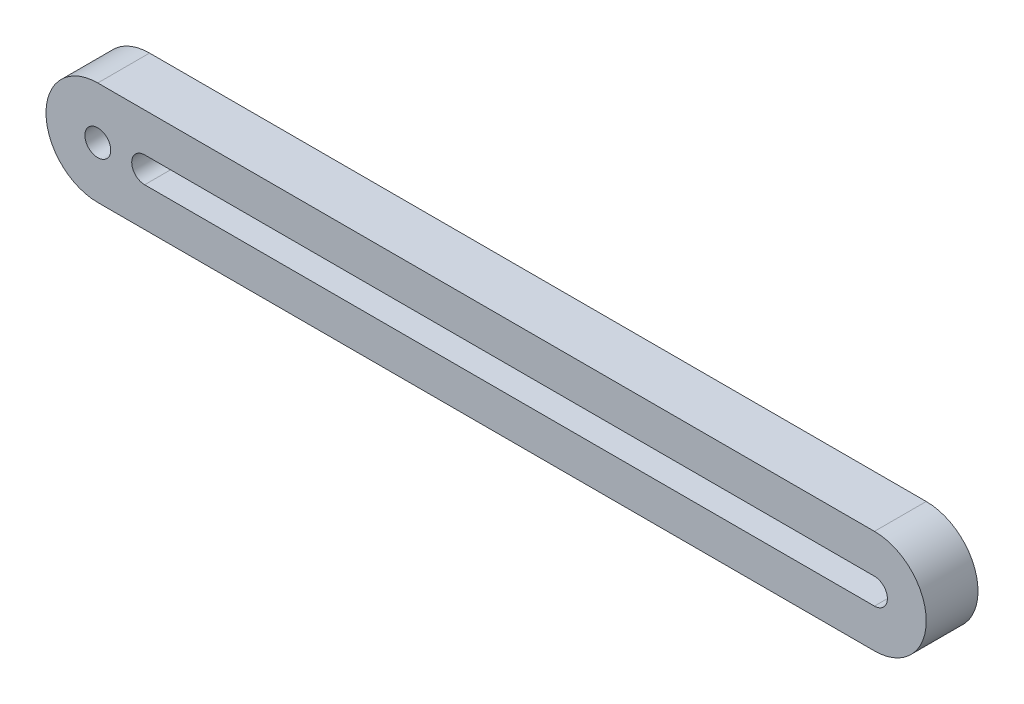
ISO-10303-21;
HEADER;
FILE_DESCRIPTION(('STEP AP214'),'2;1');
FILE_NAME('part.step','',(''),(''),'','','');
FILE_SCHEMA(('AUTOMOTIVE_DESIGN { 1 0 10303 214 1 1 1 1 }'));
ENDSEC;
DATA;
#1=APPLICATION_CONTEXT('core data for automotive mechanical design processes');
#2=APPLICATION_PROTOCOL_DEFINITION('international standard','automotive_design',2000,#1);
#3=PRODUCT_CONTEXT('',#1,'mechanical');
#4=PRODUCT('Part','Part','',(#3));
#5=PRODUCT_RELATED_PRODUCT_CATEGORY('part','',(#4));
#6=PRODUCT_DEFINITION_FORMATION('','',#4);
#7=PRODUCT_DEFINITION_CONTEXT('part definition',#1,'design');
#8=PRODUCT_DEFINITION('design','',#6,#7);
#9=PRODUCT_DEFINITION_SHAPE('','',#8);
#10=(LENGTH_UNIT() NAMED_UNIT(*) SI_UNIT(.MILLI.,.METRE.));
#11=(NAMED_UNIT(*) PLANE_ANGLE_UNIT() SI_UNIT($,.RADIAN.));
#12=(NAMED_UNIT(*) SI_UNIT($,.STERADIAN.) SOLID_ANGLE_UNIT());
#13=UNCERTAINTY_MEASURE_WITH_UNIT(LENGTH_MEASURE(1.E-05),#10,'distance_accuracy_value','');
#14=(GEOMETRIC_REPRESENTATION_CONTEXT(3) GLOBAL_UNCERTAINTY_ASSIGNED_CONTEXT((#13)) GLOBAL_UNIT_ASSIGNED_CONTEXT((#10,
#11,#12)) REPRESENTATION_CONTEXT('',''));
#15=CARTESIAN_POINT('',(0.,0.,0.));
#16=DIRECTION('',(0.,0.,1.));
#17=DIRECTION('',(1.,0.,0.));
#18=AXIS2_PLACEMENT_3D('',#15,#16,#17);
#19=CARTESIAN_POINT('',(0.,0.,2.54));
#20=DIRECTION('',(0.,0.,-1.));
#21=DIRECTION('',(-1.,0.,0.));
#22=AXIS2_PLACEMENT_3D('',#19,#20,#21);
#23=CYLINDRICAL_SURFACE('',#22,2.54);
#24=CARTESIAN_POINT('',(0.,0.,0.));
#25=DIRECTION('',(0.,0.,1.));
#26=DIRECTION('',(1.,0.,0.));
#27=AXIS2_PLACEMENT_3D('',#24,#25,#26);
#28=CIRCLE('',#27,2.54);
#29=CARTESIAN_POINT('',(0.,2.54,0.));
#30=VERTEX_POINT('',#29);
#31=CARTESIAN_POINT('',(0.,-2.54,0.));
#32=VERTEX_POINT('',#31);
#33=EDGE_CURVE('E122',#30,#32,#28,.T.);
#34=ORIENTED_EDGE('',*,*,#33,.T.);
#35=DIRECTION('',(0.,0.,-1.));
#36=VECTOR('',#35,1.);
#37=CARTESIAN_POINT('',(0.,-2.54,2.54));
#38=LINE('',#37,#36);
#39=CARTESIAN_POINT('',(0.,-2.54,2.54));
#40=VERTEX_POINT('',#39);
#41=EDGE_CURVE('E11',#40,#32,#38,.T.);
#42=ORIENTED_EDGE('',*,*,#41,.F.);
#43=CARTESIAN_POINT('',(0.,0.,2.54));
#44=DIRECTION('',(0.,0.,1.));
#45=DIRECTION('',(1.,0.,0.));
#46=AXIS2_PLACEMENT_3D('',#43,#44,#45);
#47=CIRCLE('',#46,2.54);
#48=CARTESIAN_POINT('',(0.,2.54,2.54));
#49=VERTEX_POINT('',#48);
#50=EDGE_CURVE('E117',#49,#40,#47,.T.);
#51=ORIENTED_EDGE('',*,*,#50,.F.);
#52=DIRECTION('',(0.,0.,-1.));
#53=VECTOR('',#52,1.);
#54=CARTESIAN_POINT('',(0.,2.54,2.54));
#55=LINE('',#54,#53);
#56=EDGE_CURVE('E112',#49,#30,#55,.T.);
#57=ORIENTED_EDGE('',*,*,#56,.T.);
#58=EDGE_LOOP('',(#34,#42,#51,#57));
#59=FACE_BOUND('',#58,.T.);
#60=ADVANCED_FACE('F32',(#59),#23,.T.);
#61=CARTESIAN_POINT('',(0.,-2.54,2.54));
#62=DIRECTION('',(0.,1.,0.));
#63=DIRECTION('',(0.,0.,1.));
#64=AXIS2_PLACEMENT_3D('',#61,#62,#63);
#65=PLANE('',#64);
#66=DIRECTION('',(1.,0.,0.));
#67=VECTOR('',#66,1.);
#68=CARTESIAN_POINT('',(0.,-2.54,0.));
#69=LINE('',#68,#67);
#70=CARTESIAN_POINT('',(38.1,-2.54,0.));
#71=VERTEX_POINT('',#70);
#72=EDGE_CURVE('E127',#32,#71,#69,.T.);
#73=ORIENTED_EDGE('',*,*,#72,.T.);
#74=DIRECTION('',(0.,0.,-1.));
#75=VECTOR('',#74,1.);
#76=CARTESIAN_POINT('',(38.1,-2.54,2.54));
#77=LINE('',#76,#75);
#78=CARTESIAN_POINT('',(38.1,-2.54,2.54));
#79=VERTEX_POINT('',#78);
#80=EDGE_CURVE('E41',#79,#71,#77,.T.);
#81=ORIENTED_EDGE('',*,*,#80,.F.);
#82=DIRECTION('',(1.,0.,0.));
#83=VECTOR('',#82,1.);
#84=CARTESIAN_POINT('',(0.,-2.54,2.54));
#85=LINE('',#84,#83);
#86=EDGE_CURVE('E156',#40,#79,#85,.T.);
#87=ORIENTED_EDGE('',*,*,#86,.F.);
#88=ORIENTED_EDGE('',*,*,#41,.T.);
#89=EDGE_LOOP('',(#73,#81,#87,#88));
#90=FACE_BOUND('',#89,.T.);
#91=ADVANCED_FACE('F163',(#90),#65,.F.);
#92=CARTESIAN_POINT('',(38.1,0.,2.54));
#93=DIRECTION('',(0.,0.,-1.));
#94=DIRECTION('',(-1.,0.,0.));
#95=AXIS2_PLACEMENT_3D('',#92,#93,#94);
#96=CYLINDRICAL_SURFACE('',#95,2.54);
#97=CARTESIAN_POINT('',(38.1,0.,0.));
#98=DIRECTION('',(0.,0.,1.));
#99=DIRECTION('',(1.,0.,0.));
#100=AXIS2_PLACEMENT_3D('',#97,#98,#99);
#101=CIRCLE('',#100,2.54);
#102=CARTESIAN_POINT('',(38.1,2.54,0.));
#103=VERTEX_POINT('',#102);
#104=EDGE_CURVE('E102',#71,#103,#101,.T.);
#105=ORIENTED_EDGE('',*,*,#104,.T.);
#106=DIRECTION('',(0.,0.,-1.));
#107=VECTOR('',#106,1.);
#108=CARTESIAN_POINT('',(38.1,2.54,2.54));
#109=LINE('',#108,#107);
#110=CARTESIAN_POINT('',(38.1,2.54,2.54));
#111=VERTEX_POINT('',#110);
#112=EDGE_CURVE('E114',#111,#103,#109,.T.);
#113=ORIENTED_EDGE('',*,*,#112,.F.);
#114=CARTESIAN_POINT('',(38.1,0.,2.54));
#115=DIRECTION('',(0.,0.,1.));
#116=DIRECTION('',(1.,0.,0.));
#117=AXIS2_PLACEMENT_3D('',#114,#115,#116);
#118=CIRCLE('',#117,2.54);
#119=EDGE_CURVE('E157',#79,#111,#118,.T.);
#120=ORIENTED_EDGE('',*,*,#119,.F.);
#121=ORIENTED_EDGE('',*,*,#80,.T.);
#122=EDGE_LOOP('',(#105,#113,#120,#121));
#123=FACE_BOUND('',#122,.T.);
#124=ADVANCED_FACE('F164',(#123),#96,.T.);
#125=CARTESIAN_POINT('',(0.,2.54,2.54));
#126=DIRECTION('',(0.,-1.,0.));
#127=DIRECTION('',(0.,0.,-1.));
#128=AXIS2_PLACEMENT_3D('',#125,#126,#127);
#129=PLANE('',#128);
#130=DIRECTION('',(-1.,0.,0.));
#131=VECTOR('',#130,1.);
#132=CARTESIAN_POINT('',(0.,2.54,0.));
#133=LINE('',#132,#131);
#134=EDGE_CURVE('E108',#103,#30,#133,.T.);
#135=ORIENTED_EDGE('',*,*,#134,.T.);
#136=ORIENTED_EDGE('',*,*,#56,.F.);
#137=DIRECTION('',(-1.,0.,0.));
#138=VECTOR('',#137,1.);
#139=CARTESIAN_POINT('',(0.,2.54,2.54));
#140=LINE('',#139,#138);
#141=EDGE_CURVE('E124',#111,#49,#140,.T.);
#142=ORIENTED_EDGE('',*,*,#141,.F.);
#143=ORIENTED_EDGE('',*,*,#112,.T.);
#144=EDGE_LOOP('',(#135,#136,#142,#143));
#145=FACE_BOUND('',#144,.T.);
#146=ADVANCED_FACE('F110',(#145),#129,.F.);
#147=CARTESIAN_POINT('',(0.,0.,2.54));
#148=DIRECTION('',(0.,0.,1.));
#149=DIRECTION('',(1.,0.,0.));
#150=AXIS2_PLACEMENT_3D('',#147,#148,#149);
#151=PLANE('',#150);
#152=DIRECTION('',(1.,0.,0.));
#153=VECTOR('',#152,1.);
#154=CARTESIAN_POINT('',(2.29995629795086,0.635,2.54));
#155=LINE('',#154,#153);
#156=CARTESIAN_POINT('',(38.1,0.635,2.54));
#157=VERTEX_POINT('',#156);
#158=CARTESIAN_POINT('',(2.29995629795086,0.635,2.54));
#159=VERTEX_POINT('',#158);
#160=EDGE_CURVE('E68',#157,#159,#155,.F.);
#161=ORIENTED_EDGE('',*,*,#160,.F.);
#162=CARTESIAN_POINT('',(38.1,0.,2.54));
#163=DIRECTION('',(0.,0.,1.));
#164=DIRECTION('',(1.,0.,0.));
#165=AXIS2_PLACEMENT_3D('',#162,#163,#164);
#166=CIRCLE('',#165,0.635);
#167=CARTESIAN_POINT('',(38.1,-0.635,2.54));
#168=VERTEX_POINT('',#167);
#169=EDGE_CURVE('E141',#157,#168,#166,.F.);
#170=ORIENTED_EDGE('',*,*,#169,.T.);
#171=DIRECTION('',(1.,0.,0.));
#172=VECTOR('',#171,1.);
#173=CARTESIAN_POINT('',(2.29995629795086,-0.635,2.54));
#174=LINE('',#173,#172);
#175=CARTESIAN_POINT('',(2.29995629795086,-0.635,2.54));
#176=VERTEX_POINT('',#175);
#177=EDGE_CURVE('E50',#176,#168,#174,.T.);
#178=ORIENTED_EDGE('',*,*,#177,.F.);
#179=CARTESIAN_POINT('',(2.29995629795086,0.,2.54));
#180=DIRECTION('',(0.,0.,1.));
#181=DIRECTION('',(1.,0.,0.));
#182=AXIS2_PLACEMENT_3D('',#179,#180,#181);
#183=CIRCLE('',#182,0.635);
#184=EDGE_CURVE('E35',#159,#176,#183,.T.);
#185=ORIENTED_EDGE('',*,*,#184,.F.);
#186=EDGE_LOOP('',(#161,#170,#178,#185));
#187=FACE_BOUND('',#186,.T.);
#188=CARTESIAN_POINT('',(0.,0.,2.54));
#189=DIRECTION('',(0.,0.,1.));
#190=DIRECTION('',(1.,0.,0.));
#191=AXIS2_PLACEMENT_3D('',#188,#189,#190);
#192=CIRCLE('',#191,0.635);
#193=CARTESIAN_POINT('',(0.635,0.,2.54));
#194=VERTEX_POINT('',#193);
#195=EDGE_CURVE('E128',#194,#194,#192,.T.);
#196=ORIENTED_EDGE('',*,*,#195,.F.);
#197=EDGE_LOOP('',(#196));
#198=FACE_BOUND('',#197,.T.);
#199=ORIENTED_EDGE('',*,*,#50,.T.);
#200=ORIENTED_EDGE('',*,*,#86,.T.);
#201=ORIENTED_EDGE('',*,*,#119,.T.);
#202=ORIENTED_EDGE('',*,*,#141,.T.);
#203=EDGE_LOOP('',(#199,#200,#201,#202));
#204=FACE_BOUND('',#203,.T.);
#205=ADVANCED_FACE('F160',(#187,#198,#204),#151,.T.);
#206=CARTESIAN_POINT('',(0.,0.,0.));
#207=DIRECTION('',(0.,0.,1.));
#208=DIRECTION('',(1.,0.,0.));
#209=AXIS2_PLACEMENT_3D('',#206,#207,#208);
#210=PLANE('',#209);
#211=CARTESIAN_POINT('',(38.1,0.,0.));
#212=DIRECTION('',(0.,0.,-1.));
#213=DIRECTION('',(-1.,0.,0.));
#214=AXIS2_PLACEMENT_3D('',#211,#212,#213);
#215=CIRCLE('',#214,0.635);
#216=CARTESIAN_POINT('',(38.1,0.635,0.));
#217=VERTEX_POINT('',#216);
#218=CARTESIAN_POINT('',(38.1,-0.635,0.));
#219=VERTEX_POINT('',#218);
#220=EDGE_CURVE('E143',#217,#219,#215,.T.);
#221=ORIENTED_EDGE('',*,*,#220,.F.);
#222=DIRECTION('',(-1.,0.,0.));
#223=VECTOR('',#222,1.);
#224=CARTESIAN_POINT('',(2.29995629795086,0.635,0.));
#225=LINE('',#224,#223);
#226=CARTESIAN_POINT('',(2.29995629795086,0.635,0.));
#227=VERTEX_POINT('',#226);
#228=EDGE_CURVE('E259',#217,#227,#225,.T.);
#229=ORIENTED_EDGE('',*,*,#228,.T.);
#230=CARTESIAN_POINT('',(2.29995629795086,0.,0.));
#231=DIRECTION('',(0.,0.,1.));
#232=DIRECTION('',(1.,0.,0.));
#233=AXIS2_PLACEMENT_3D('',#230,#231,#232);
#234=CIRCLE('',#233,0.635);
#235=CARTESIAN_POINT('',(2.29995629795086,-0.635,0.));
#236=VERTEX_POINT('',#235);
#237=EDGE_CURVE('E262',#227,#236,#234,.T.);
#238=ORIENTED_EDGE('',*,*,#237,.T.);
#239=DIRECTION('',(1.,0.,0.));
#240=VECTOR('',#239,1.);
#241=CARTESIAN_POINT('',(2.29995629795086,-0.635,0.));
#242=LINE('',#241,#240);
#243=EDGE_CURVE('E261',#236,#219,#242,.T.);
#244=ORIENTED_EDGE('',*,*,#243,.T.);
#245=EDGE_LOOP('',(#221,#229,#238,#244));
#246=FACE_BOUND('',#245,.T.);
#247=CARTESIAN_POINT('',(0.,0.,0.));
#248=DIRECTION('',(0.,0.,1.));
#249=DIRECTION('',(1.,0.,0.));
#250=AXIS2_PLACEMENT_3D('',#247,#248,#249);
#251=CIRCLE('',#250,0.635);
#252=CARTESIAN_POINT('',(0.635,0.,0.));
#253=VERTEX_POINT('',#252);
#254=EDGE_CURVE('E132',#253,#253,#251,.T.);
#255=ORIENTED_EDGE('',*,*,#254,.T.);
#256=EDGE_LOOP('',(#255));
#257=FACE_BOUND('',#256,.T.);
#258=ORIENTED_EDGE('',*,*,#33,.F.);
#259=ORIENTED_EDGE('',*,*,#134,.F.);
#260=ORIENTED_EDGE('',*,*,#104,.F.);
#261=ORIENTED_EDGE('',*,*,#72,.F.);
#262=EDGE_LOOP('',(#258,#259,#260,#261));
#263=FACE_BOUND('',#262,.T.);
#264=ADVANCED_FACE('F126',(#246,#257,#263),#210,.F.);
#265=CARTESIAN_POINT('',(0.,0.,0.));
#266=DIRECTION('',(0.,0.,1.));
#267=DIRECTION('',(1.,0.,0.));
#268=AXIS2_PLACEMENT_3D('',#265,#266,#267);
#269=CYLINDRICAL_SURFACE('',#268,0.635);
#270=ORIENTED_EDGE('',*,*,#195,.T.);
#271=EDGE_LOOP('',(#270));
#272=FACE_BOUND('',#271,.T.);
#273=ORIENTED_EDGE('',*,*,#254,.F.);
#274=EDGE_LOOP('',(#273));
#275=FACE_BOUND('',#274,.T.);
#276=ADVANCED_FACE('F196',(#272,#275),#269,.F.);
#277=CARTESIAN_POINT('',(38.1,0.,0.));
#278=DIRECTION('',(0.,0.,1.));
#279=DIRECTION('',(1.,0.,0.));
#280=AXIS2_PLACEMENT_3D('',#277,#278,#279);
#281=CYLINDRICAL_SURFACE('',#280,0.635);
#282=DIRECTION('',(0.,0.,1.));
#283=VECTOR('',#282,1.);
#284=CARTESIAN_POINT('',(38.1,0.635,0.));
#285=LINE('',#284,#283);
#286=EDGE_CURVE('E151',#217,#157,#285,.T.);
#287=ORIENTED_EDGE('',*,*,#286,.F.);
#288=ORIENTED_EDGE('',*,*,#220,.T.);
#289=DIRECTION('',(0.,0.,1.));
#290=VECTOR('',#289,1.);
#291=CARTESIAN_POINT('',(38.1,-0.635,0.));
#292=LINE('',#291,#290);
#293=EDGE_CURVE('E254',#219,#168,#292,.T.);
#294=ORIENTED_EDGE('',*,*,#293,.T.);
#295=ORIENTED_EDGE('',*,*,#169,.F.);
#296=EDGE_LOOP('',(#287,#288,#294,#295));
#297=FACE_BOUND('',#296,.T.);
#298=ADVANCED_FACE('F201',(#297),#281,.F.);
#299=CARTESIAN_POINT('',(2.29995629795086,0.,0.));
#300=DIRECTION('',(0.,0.,1.));
#301=DIRECTION('',(1.,0.,0.));
#302=AXIS2_PLACEMENT_3D('',#299,#300,#301);
#303=CYLINDRICAL_SURFACE('',#302,0.635);
#304=ORIENTED_EDGE('',*,*,#184,.T.);
#305=DIRECTION('',(0.,0.,1.));
#306=VECTOR('',#305,1.);
#307=CARTESIAN_POINT('',(2.29995629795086,-0.635,0.));
#308=LINE('',#307,#306);
#309=EDGE_CURVE('E264',#236,#176,#308,.T.);
#310=ORIENTED_EDGE('',*,*,#309,.F.);
#311=ORIENTED_EDGE('',*,*,#237,.F.);
#312=DIRECTION('',(0.,0.,1.));
#313=VECTOR('',#312,1.);
#314=CARTESIAN_POINT('',(2.29995629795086,0.635,0.));
#315=LINE('',#314,#313);
#316=EDGE_CURVE('E81',#227,#159,#315,.T.);
#317=ORIENTED_EDGE('',*,*,#316,.T.);
#318=EDGE_LOOP('',(#304,#310,#311,#317));
#319=FACE_BOUND('',#318,.T.);
#320=ADVANCED_FACE('F223',(#319),#303,.F.);
#321=CARTESIAN_POINT('',(2.29995629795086,0.635,0.));
#322=DIRECTION('',(0.,1.,0.));
#323=DIRECTION('',(0.,0.,1.));
#324=AXIS2_PLACEMENT_3D('',#321,#322,#323);
#325=PLANE('',#324);
#326=ORIENTED_EDGE('',*,*,#160,.T.);
#327=ORIENTED_EDGE('',*,*,#316,.F.);
#328=ORIENTED_EDGE('',*,*,#228,.F.);
#329=ORIENTED_EDGE('',*,*,#286,.T.);
#330=EDGE_LOOP('',(#326,#327,#328,#329));
#331=FACE_BOUND('',#330,.T.);
#332=ADVANCED_FACE('F230',(#331),#325,.F.);
#333=CARTESIAN_POINT('',(2.29995629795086,-0.635,0.));
#334=DIRECTION('',(0.,-1.,0.));
#335=DIRECTION('',(0.,0.,-1.));
#336=AXIS2_PLACEMENT_3D('',#333,#334,#335);
#337=PLANE('',#336);
#338=ORIENTED_EDGE('',*,*,#177,.T.);
#339=ORIENTED_EDGE('',*,*,#293,.F.);
#340=ORIENTED_EDGE('',*,*,#243,.F.);
#341=ORIENTED_EDGE('',*,*,#309,.T.);
#342=EDGE_LOOP('',(#338,#339,#340,#341));
#343=FACE_BOUND('',#342,.T.);
#344=ADVANCED_FACE('F239',(#343),#337,.F.);
#345=CLOSED_SHELL('',(#60,#91,#124,#146,#205,#264,#276,#298,#320,#332,#344));
#346=MANIFOLD_SOLID_BREP('B2',#345);
#347=ADVANCED_BREP_SHAPE_REPRESENTATION('',(#18,#346),#14);
#348=SHAPE_DEFINITION_REPRESENTATION(#9,#347);
ENDSEC;
END-ISO-10303-21;
